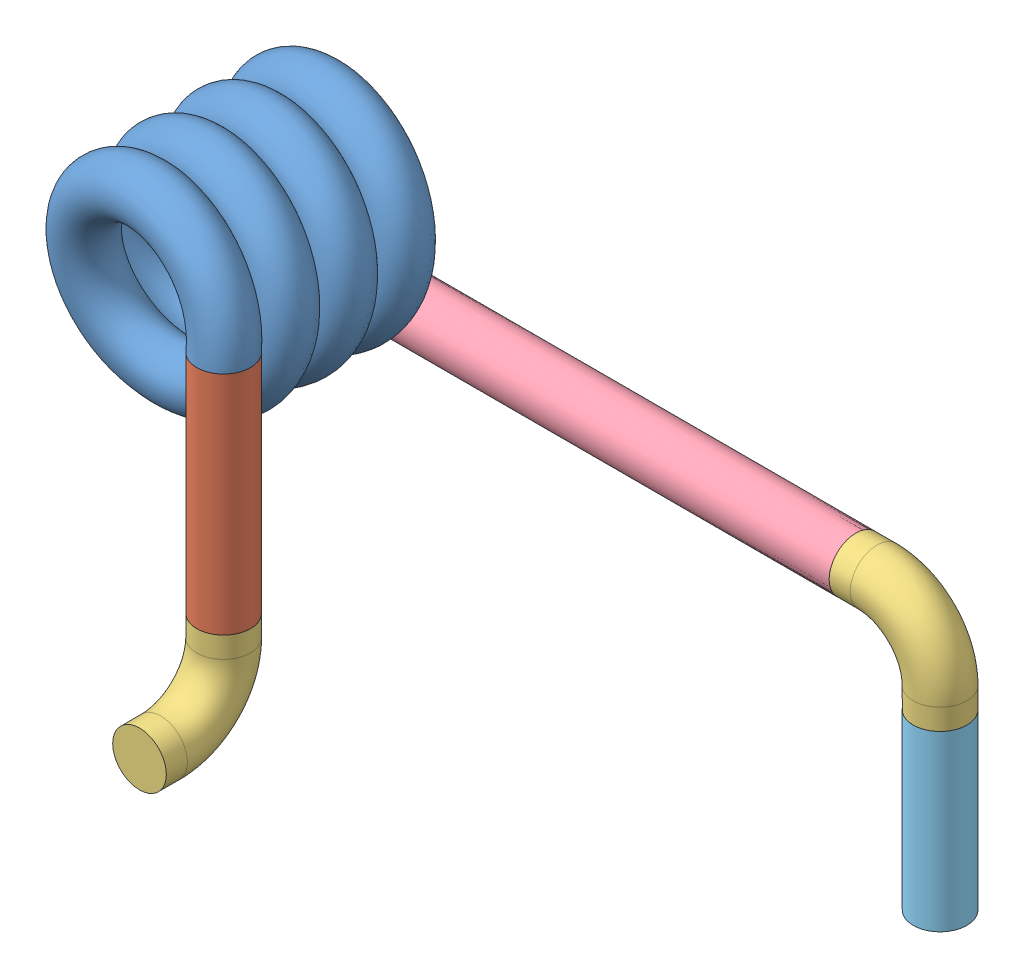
SolidWorks assembly 10-600056-100 Rev A.SLDASM, configuration Default (file format 10000). Lengths in mm.
Overall size (17.42 10.93 7.92).
6 component instances, 5 part files, 10 mates.
Components (placement in the parent):
- 15-600056-100 Rev A-1: 15-600056-100 Rev A.SLDPRT [Default] at (1.6762 4.9888 3.6889) size (5.36 5.36 6.53)
- 15-600056-102 Rev A-4: 15-600056-102 Rev A.SLDPRT [Default] at (3.7082 4.9888 8.5784) x (1 0 0) z (0 -1 0) size (1.3 1.3 5.46)
- 15-600056-101 Rev A-3: 15-600056-101 Rev A.SLDPRT [Default] at (3.7082 -2.5042 10.6104) x (0 0 1) z (1 0 0) size (2.68 2.68 1.3)
- 15-600056-104 Rev A-1: 15-600056-104 Rev A.SLDPRT [Default] at (1.6762 2.9568 3.3397) x (0 0 -1) z (1 0 0) size (1.3 1.3 12.06)
- 15-600056-101 Rev A-4: 15-600056-101 Rev A.SLDPRT [Default] at (15.7732 0.9248 3.3397) x (0 -1 0) z (0 0 1) size (2.68 2.68 1.3)
- 15-600056-105 Rev A-1: 15-600056-105 Rev A.SLDPRT [Default] at (15.7732 0.9248 3.3397) x (1 0 0) z (0 -1 0) size (1.3 1.3 4.19)
Mates (geometry in assembly coordinates):
- Coincident2: coincident anti-aligned: plane of 15-600056-100 Rev A-1 through (3.7082 4.9888 7.9307) normal (0 -1 0); plane of 15-600056-102 Rev A-4 through (3.7082 4.9888 8.5784) normal (0 1 0)
- Coincident3: coincident anti-aligned: circle of 15-600056-100 Rev A-1; circle of 15-600056-102 Rev A-4
- Coincident4: coincident anti-aligned: plane of 15-600056-102 Rev A-4 through (3.7082 -0.4722 8.5784) normal (0 -1 0); plane of 15-600056-101 Rev A-3 through (3.7082 -0.4722 8.5784) normal (0 1 0)
- Coincident5: coincident aligned: circle of 15-600056-102 Rev A-4; circle of 15-600056-101 Rev A-3
- Coincident8: coincident anti-aligned: plane of 15-600056-100 Rev A-1 through (1.6762 2.9568 2.692) normal (1 0 0); plane of 15-600056-104 Rev A-1 through (1.6762 2.9568 3.3397) normal (-1 0 0)
- Coincident9: coincident anti-aligned: circle of 15-600056-100 Rev A-1; circle of 15-600056-104 Rev A-1
- Coincident10: coincident anti-aligned: plane of 15-600056-104 Rev A-1 through (13.7412 2.9568 3.3397) normal (1 0 0); plane of 15-600056-101 Rev A-4 through (13.7412 2.9568 3.3397) normal (-1 0 0)
- Coincident11: coincident aligned: circle of 15-600056-104 Rev A-1; circle of 15-600056-101 Rev A-4
- Coincident12: coincident anti-aligned: plane of 15-600056-101 Rev A-4 through (15.7732 0.9248 3.3397) normal (0 -1 0); plane of 15-600056-105 Rev A-1 through (15.7732 0.9248 3.3397) normal (0 1 0)
- Coincident13: coincident aligned: circle of 15-600056-101 Rev A-4; circle of 15-600056-105 Rev A-1
